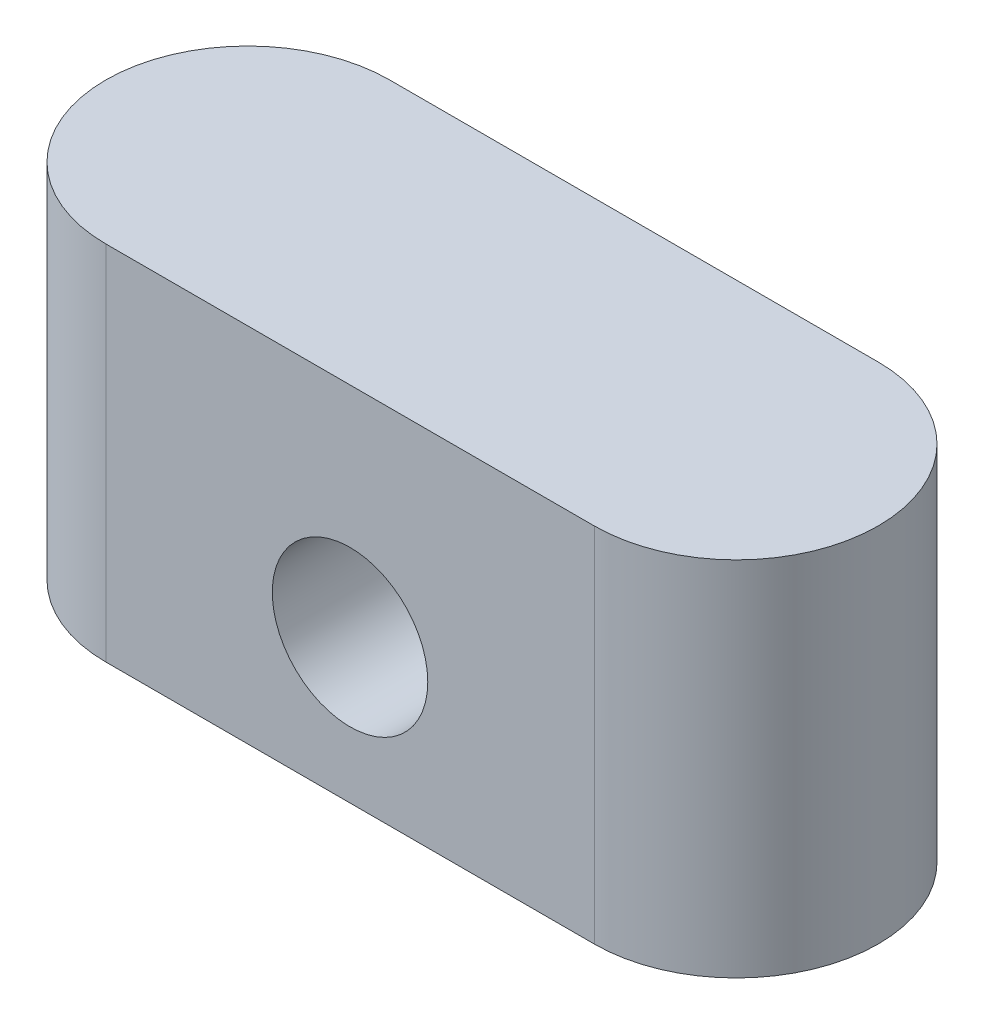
ISO-10303-21;
HEADER;
FILE_DESCRIPTION(('STEP AP214'),'2;1');
FILE_NAME('part.step','',(''),(''),'','','');
FILE_SCHEMA(('AUTOMOTIVE_DESIGN { 1 0 10303 214 1 1 1 1 }'));
ENDSEC;
DATA;
#1=APPLICATION_CONTEXT('core data for automotive mechanical design processes');
#2=APPLICATION_PROTOCOL_DEFINITION('international standard','automotive_design',2000,#1);
#3=PRODUCT_CONTEXT('',#1,'mechanical');
#4=PRODUCT('Part','Part','',(#3));
#5=PRODUCT_RELATED_PRODUCT_CATEGORY('part','',(#4));
#6=PRODUCT_DEFINITION_FORMATION('','',#4);
#7=PRODUCT_DEFINITION_CONTEXT('part definition',#1,'design');
#8=PRODUCT_DEFINITION('design','',#6,#7);
#9=PRODUCT_DEFINITION_SHAPE('','',#8);
#10=(LENGTH_UNIT() NAMED_UNIT(*) SI_UNIT(.MILLI.,.METRE.));
#11=(NAMED_UNIT(*) PLANE_ANGLE_UNIT() SI_UNIT($,.RADIAN.));
#12=(NAMED_UNIT(*) SI_UNIT($,.STERADIAN.) SOLID_ANGLE_UNIT());
#13=UNCERTAINTY_MEASURE_WITH_UNIT(LENGTH_MEASURE(1.E-05),#10,'distance_accuracy_value','');
#14=(GEOMETRIC_REPRESENTATION_CONTEXT(3) GLOBAL_UNCERTAINTY_ASSIGNED_CONTEXT((#13)) GLOBAL_UNIT_ASSIGNED_CONTEXT((#10,
#11,#12)) REPRESENTATION_CONTEXT('',''));
#15=CARTESIAN_POINT('',(0.,0.,0.));
#16=DIRECTION('',(0.,0.,1.));
#17=DIRECTION('',(1.,0.,0.));
#18=AXIS2_PLACEMENT_3D('',#15,#16,#17);
#19=CARTESIAN_POINT('',(-4.25,3.15,0.));
#20=DIRECTION('',(0.,-1.,0.));
#21=DIRECTION('',(0.,0.,-1.));
#22=AXIS2_PLACEMENT_3D('',#19,#20,#21);
#23=CYLINDRICAL_SURFACE('',#22,2.47015);
#24=CARTESIAN_POINT('',(-4.25,-3.15,0.));
#25=DIRECTION('',(0.,1.,0.));
#26=DIRECTION('',(0.,0.,1.));
#27=AXIS2_PLACEMENT_3D('',#24,#25,#26);
#28=CIRCLE('',#27,2.47015);
#29=CARTESIAN_POINT('',(-4.25,-3.15,-2.47015));
#30=VERTEX_POINT('',#29);
#31=CARTESIAN_POINT('',(-4.25,-3.15,2.47015));
#32=VERTEX_POINT('',#31);
#33=EDGE_CURVE('E97',#30,#32,#28,.T.);
#34=ORIENTED_EDGE('',*,*,#33,.T.);
#35=DIRECTION('',(0.,-1.,0.));
#36=VECTOR('',#35,1.);
#37=CARTESIAN_POINT('',(-4.25,3.15,2.47015));
#38=LINE('',#37,#36);
#39=CARTESIAN_POINT('',(-4.25,3.15,2.47015));
#40=VERTEX_POINT('',#39);
#41=EDGE_CURVE('E11',#40,#32,#38,.T.);
#42=ORIENTED_EDGE('',*,*,#41,.F.);
#43=CARTESIAN_POINT('',(-4.25,3.15,0.));
#44=DIRECTION('',(0.,1.,0.));
#45=DIRECTION('',(0.,0.,1.));
#46=AXIS2_PLACEMENT_3D('',#43,#44,#45);
#47=CIRCLE('',#46,2.47015);
#48=CARTESIAN_POINT('',(-4.25,3.15,-2.47015));
#49=VERTEX_POINT('',#48);
#50=EDGE_CURVE('E85',#49,#40,#47,.T.);
#51=ORIENTED_EDGE('',*,*,#50,.F.);
#52=DIRECTION('',(0.,-1.,0.));
#53=VECTOR('',#52,1.);
#54=CARTESIAN_POINT('',(-4.25,3.15,-2.47015));
#55=LINE('',#54,#53);
#56=EDGE_CURVE('E93',#49,#30,#55,.T.);
#57=ORIENTED_EDGE('',*,*,#56,.T.);
#58=EDGE_LOOP('',(#34,#42,#51,#57));
#59=FACE_BOUND('',#58,.T.);
#60=ADVANCED_FACE('F34',(#59),#23,.T.);
#61=CARTESIAN_POINT('',(-4.25,3.15,2.47015));
#62=DIRECTION('',(0.,0.,-1.));
#63=DIRECTION('',(-1.,0.,0.));
#64=AXIS2_PLACEMENT_3D('',#61,#62,#63);
#65=PLANE('',#64);
#66=CARTESIAN_POINT('',(0.,-0.65,2.47015));
#67=DIRECTION('',(0.,0.,1.));
#68=DIRECTION('',(1.,0.,0.));
#69=AXIS2_PLACEMENT_3D('',#66,#67,#68);
#70=CIRCLE('',#69,1.35255);
#71=CARTESIAN_POINT('',(1.35255,-0.65,2.47015));
#72=VERTEX_POINT('',#71);
#73=EDGE_CURVE('E113',#72,#72,#70,.T.);
#74=ORIENTED_EDGE('',*,*,#73,.F.);
#75=EDGE_LOOP('',(#74));
#76=FACE_BOUND('',#75,.T.);
#77=DIRECTION('',(1.,0.,0.));
#78=VECTOR('',#77,1.);
#79=CARTESIAN_POINT('',(-4.25,-3.15,2.47015));
#80=LINE('',#79,#78);
#81=CARTESIAN_POINT('',(4.25,-3.15,2.47015));
#82=VERTEX_POINT('',#81);
#83=EDGE_CURVE('E89',#32,#82,#80,.T.);
#84=ORIENTED_EDGE('',*,*,#83,.T.);
#85=DIRECTION('',(0.,-1.,0.));
#86=VECTOR('',#85,1.);
#87=CARTESIAN_POINT('',(4.25,3.15,2.47015));
#88=LINE('',#87,#86);
#89=CARTESIAN_POINT('',(4.25,3.15,2.47015));
#90=VERTEX_POINT('',#89);
#91=EDGE_CURVE('E42',#90,#82,#88,.T.);
#92=ORIENTED_EDGE('',*,*,#91,.F.);
#93=DIRECTION('',(1.,0.,0.));
#94=VECTOR('',#93,1.);
#95=CARTESIAN_POINT('',(-4.25,3.15,2.47015));
#96=LINE('',#95,#94);
#97=EDGE_CURVE('E80',#40,#90,#96,.T.);
#98=ORIENTED_EDGE('',*,*,#97,.F.);
#99=ORIENTED_EDGE('',*,*,#41,.T.);
#100=EDGE_LOOP('',(#84,#92,#98,#99));
#101=FACE_BOUND('',#100,.T.);
#102=ADVANCED_FACE('F88',(#76,#101),#65,.F.);
#103=CARTESIAN_POINT('',(4.25,3.15,0.));
#104=DIRECTION('',(0.,-1.,0.));
#105=DIRECTION('',(0.,0.,-1.));
#106=AXIS2_PLACEMENT_3D('',#103,#104,#105);
#107=CYLINDRICAL_SURFACE('',#106,2.47015);
#108=CARTESIAN_POINT('',(4.25,-3.15,0.));
#109=DIRECTION('',(0.,1.,0.));
#110=DIRECTION('',(0.,0.,1.));
#111=AXIS2_PLACEMENT_3D('',#108,#109,#110);
#112=CIRCLE('',#111,2.47015);
#113=CARTESIAN_POINT('',(4.25,-3.15,-2.47015));
#114=VERTEX_POINT('',#113);
#115=EDGE_CURVE('E67',#82,#114,#112,.T.);
#116=ORIENTED_EDGE('',*,*,#115,.T.);
#117=DIRECTION('',(0.,-1.,0.));
#118=VECTOR('',#117,1.);
#119=CARTESIAN_POINT('',(4.25,3.15,-2.47015));
#120=LINE('',#119,#118);
#121=CARTESIAN_POINT('',(4.25,3.15,-2.47015));
#122=VERTEX_POINT('',#121);
#123=EDGE_CURVE('E90',#122,#114,#120,.T.);
#124=ORIENTED_EDGE('',*,*,#123,.F.);
#125=CARTESIAN_POINT('',(4.25,3.15,0.));
#126=DIRECTION('',(0.,1.,0.));
#127=DIRECTION('',(0.,0.,1.));
#128=AXIS2_PLACEMENT_3D('',#125,#126,#127);
#129=CIRCLE('',#128,2.47015);
#130=EDGE_CURVE('E83',#90,#122,#129,.T.);
#131=ORIENTED_EDGE('',*,*,#130,.F.);
#132=ORIENTED_EDGE('',*,*,#91,.T.);
#133=EDGE_LOOP('',(#116,#124,#131,#132));
#134=FACE_BOUND('',#133,.T.);
#135=ADVANCED_FACE('F91',(#134),#107,.T.);
#136=CARTESIAN_POINT('',(-4.25,3.15,-2.47015));
#137=DIRECTION('',(0.,0.,1.));
#138=DIRECTION('',(1.,0.,0.));
#139=AXIS2_PLACEMENT_3D('',#136,#137,#138);
#140=PLANE('',#139);
#141=CARTESIAN_POINT('',(0.,-0.65,-2.47015));
#142=DIRECTION('',(0.,0.,1.));
#143=DIRECTION('',(1.,0.,0.));
#144=AXIS2_PLACEMENT_3D('',#141,#142,#143);
#145=CIRCLE('',#144,1.35255);
#146=CARTESIAN_POINT('',(1.35255,-0.65,-2.47015));
#147=VERTEX_POINT('',#146);
#148=EDGE_CURVE('E100',#147,#147,#145,.T.);
#149=ORIENTED_EDGE('',*,*,#148,.T.);
#150=EDGE_LOOP('',(#149));
#151=FACE_BOUND('',#150,.T.);
#152=DIRECTION('',(-1.,0.,0.));
#153=VECTOR('',#152,1.);
#154=CARTESIAN_POINT('',(-4.25,-3.15,-2.47015));
#155=LINE('',#154,#153);
#156=EDGE_CURVE('E73',#114,#30,#155,.T.);
#157=ORIENTED_EDGE('',*,*,#156,.T.);
#158=ORIENTED_EDGE('',*,*,#56,.F.);
#159=DIRECTION('',(-1.,0.,0.));
#160=VECTOR('',#159,1.);
#161=CARTESIAN_POINT('',(-4.25,3.15,-2.47015));
#162=LINE('',#161,#160);
#163=EDGE_CURVE('E50',#122,#49,#162,.T.);
#164=ORIENTED_EDGE('',*,*,#163,.F.);
#165=ORIENTED_EDGE('',*,*,#123,.T.);
#166=EDGE_LOOP('',(#157,#158,#164,#165));
#167=FACE_BOUND('',#166,.T.);
#168=ADVANCED_FACE('F105',(#151,#167),#140,.F.);
#169=CARTESIAN_POINT('',(-4.25,3.15,0.));
#170=DIRECTION('',(0.,1.,0.));
#171=DIRECTION('',(0.,0.,1.));
#172=AXIS2_PLACEMENT_3D('',#169,#170,#171);
#173=PLANE('',#172);
#174=ORIENTED_EDGE('',*,*,#50,.T.);
#175=ORIENTED_EDGE('',*,*,#97,.T.);
#176=ORIENTED_EDGE('',*,*,#130,.T.);
#177=ORIENTED_EDGE('',*,*,#163,.T.);
#178=EDGE_LOOP('',(#174,#175,#176,#177));
#179=FACE_BOUND('',#178,.T.);
#180=ADVANCED_FACE('F81',(#179),#173,.T.);
#181=CARTESIAN_POINT('',(-4.25,-3.15,0.));
#182=DIRECTION('',(0.,1.,0.));
#183=DIRECTION('',(0.,0.,1.));
#184=AXIS2_PLACEMENT_3D('',#181,#182,#183);
#185=PLANE('',#184);
#186=ORIENTED_EDGE('',*,*,#33,.F.);
#187=ORIENTED_EDGE('',*,*,#156,.F.);
#188=ORIENTED_EDGE('',*,*,#115,.F.);
#189=ORIENTED_EDGE('',*,*,#83,.F.);
#190=EDGE_LOOP('',(#186,#187,#188,#189));
#191=FACE_BOUND('',#190,.T.);
#192=ADVANCED_FACE('F108',(#191),#185,.F.);
#193=CARTESIAN_POINT('',(0.,-0.65,2.47015));
#194=DIRECTION('',(0.,0.,1.));
#195=DIRECTION('',(1.,0.,0.));
#196=AXIS2_PLACEMENT_3D('',#193,#194,#195);
#197=CYLINDRICAL_SURFACE('',#196,1.35255);
#198=ORIENTED_EDGE('',*,*,#148,.F.);
#199=EDGE_LOOP('',(#198));
#200=FACE_BOUND('',#199,.T.);
#201=ORIENTED_EDGE('',*,*,#73,.T.);
#202=EDGE_LOOP('',(#201));
#203=FACE_BOUND('',#202,.T.);
#204=ADVANCED_FACE('F117',(#200,#203),#197,.F.);
#205=CLOSED_SHELL('',(#60,#102,#135,#168,#180,#192,#204));
#206=MANIFOLD_SOLID_BREP('B2',#205);
#207=ADVANCED_BREP_SHAPE_REPRESENTATION('',(#18,#206),#14);
#208=SHAPE_DEFINITION_REPRESENTATION(#9,#207);
ENDSEC;
END-ISO-10303-21;
